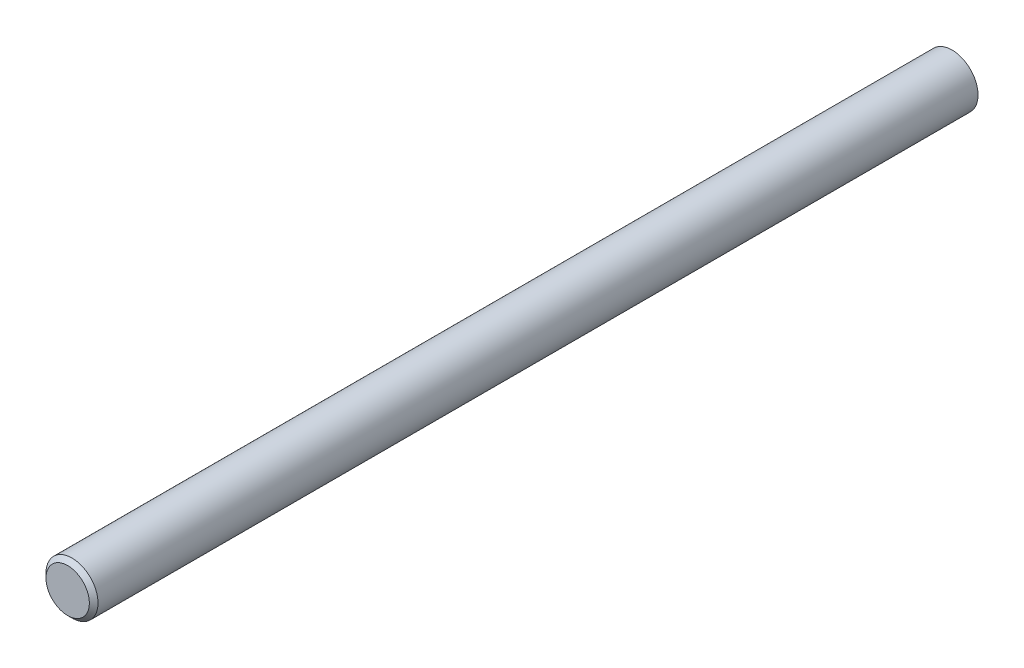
ISO-10303-21;
HEADER;
FILE_DESCRIPTION(('STEP AP214'),'2;1');
FILE_NAME('part.step','',(''),(''),'','','');
FILE_SCHEMA(('AUTOMOTIVE_DESIGN { 1 0 10303 214 1 1 1 1 }'));
ENDSEC;
DATA;
#1=APPLICATION_CONTEXT('core data for automotive mechanical design processes');
#2=APPLICATION_PROTOCOL_DEFINITION('international standard','automotive_design',2000,#1);
#3=PRODUCT_CONTEXT('',#1,'mechanical');
#4=PRODUCT('Part','Part','',(#3));
#5=PRODUCT_RELATED_PRODUCT_CATEGORY('part','',(#4));
#6=PRODUCT_DEFINITION_FORMATION('','',#4);
#7=PRODUCT_DEFINITION_CONTEXT('part definition',#1,'design');
#8=PRODUCT_DEFINITION('design','',#6,#7);
#9=PRODUCT_DEFINITION_SHAPE('','',#8);
#10=(LENGTH_UNIT() NAMED_UNIT(*) SI_UNIT(.MILLI.,.METRE.));
#11=(NAMED_UNIT(*) PLANE_ANGLE_UNIT() SI_UNIT($,.RADIAN.));
#12=(NAMED_UNIT(*) SI_UNIT($,.STERADIAN.) SOLID_ANGLE_UNIT());
#13=UNCERTAINTY_MEASURE_WITH_UNIT(LENGTH_MEASURE(1.E-05),#10,'distance_accuracy_value','');
#14=(GEOMETRIC_REPRESENTATION_CONTEXT(3) GLOBAL_UNCERTAINTY_ASSIGNED_CONTEXT((#13)) GLOBAL_UNIT_ASSIGNED_CONTEXT((#10,
#11,#12)) REPRESENTATION_CONTEXT('',''));
#15=CARTESIAN_POINT('',(0.,0.,0.));
#16=DIRECTION('',(0.,0.,1.));
#17=DIRECTION('',(1.,0.,0.));
#18=AXIS2_PLACEMENT_3D('',#15,#16,#17);
#19=CARTESIAN_POINT('',(-2.62500315,-2.62500315,71.));
#20=DIRECTION('',(0.,0.,1.));
#21=DIRECTION('',(1.,0.,0.));
#22=AXIS2_PLACEMENT_3D('',#19,#20,#21);
#23=PLANE('',#22);
#24=CARTESIAN_POINT('',(1.38994718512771E-13,0.,70.9999999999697));
#25=DIRECTION('',(0.,0.,-1.));
#26=DIRECTION('',(-1.,0.,0.));
#27=AXIS2_PLACEMENT_3D('',#24,#25,#26);
#28=CIRCLE('',#27,2.49999999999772);
#29=CARTESIAN_POINT('',(-2.49999999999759,0.,70.9999999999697));
#30=VERTEX_POINT('',#29);
#31=EDGE_CURVE('E17',#30,#30,#28,.T.);
#32=ORIENTED_EDGE('',*,*,#31,.F.);
#33=EDGE_LOOP('',(#32));
#34=FACE_BOUND('',#33,.T.);
#35=ADVANCED_FACE('F14',(#34),#23,.T.);
#36=CARTESIAN_POINT('',(1.45933612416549E-13,0.,70.4999999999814));
#37=DIRECTION('',(0.,0.,-1.));
#38=DIRECTION('',(-1.,0.,0.));
#39=AXIS2_PLACEMENT_3D('',#36,#37,#38);
#40=CONICAL_SURFACE('',#39,2.99999999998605,0.785398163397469);
#41=ORIENTED_EDGE('',*,*,#31,.T.);
#42=EDGE_LOOP('',(#41));
#43=FACE_BOUND('',#42,.T.);
#44=CARTESIAN_POINT('',(2.86026942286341E-13,-1.47496489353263E-13,70.5));
#45=DIRECTION('',(0.,0.,-1.));
#46=DIRECTION('',(-1.,0.,0.));
#47=AXIS2_PLACEMENT_3D('',#44,#45,#46);
#48=CIRCLE('',#47,3.);
#49=CARTESIAN_POINT('',(-2.99999999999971,-1.47496489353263E-13,70.5));
#50=VERTEX_POINT('',#49);
#51=EDGE_CURVE('E10',#50,#50,#48,.T.);
#52=ORIENTED_EDGE('',*,*,#51,.F.);
#53=EDGE_LOOP('',(#52));
#54=FACE_BOUND('',#53,.T.);
#55=ADVANCED_FACE('F33',(#43,#54),#40,.T.);
#56=CARTESIAN_POINT('',(0.,0.,95.));
#57=DIRECTION('',(0.,0.,-1.));
#58=DIRECTION('',(-1.,0.,0.));
#59=AXIS2_PLACEMENT_3D('',#56,#57,#58);
#60=CYLINDRICAL_SURFACE('',#59,3.);
#61=ORIENTED_EDGE('',*,*,#51,.T.);
#62=EDGE_LOOP('',(#61));
#63=FACE_BOUND('',#62,.T.);
#64=CARTESIAN_POINT('',(0.,0.,-31.));
#65=DIRECTION('',(0.,0.,-1.));
#66=DIRECTION('',(-1.,0.,0.));
#67=AXIS2_PLACEMENT_3D('',#64,#65,#66);
#68=CIRCLE('',#67,2.99999999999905);
#69=CARTESIAN_POINT('',(-2.99999999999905,0.,-31.));
#70=VERTEX_POINT('',#69);
#71=EDGE_CURVE('E24',#70,#70,#68,.T.);
#72=ORIENTED_EDGE('',*,*,#71,.F.);
#73=EDGE_LOOP('',(#72));
#74=FACE_BOUND('',#73,.T.);
#75=ADVANCED_FACE('F31',(#63,#74),#60,.T.);
#76=CARTESIAN_POINT('',(0.,0.,-31.));
#77=DIRECTION('',(0.,0.,-1.));
#78=DIRECTION('',(-1.,0.,0.));
#79=AXIS2_PLACEMENT_3D('',#76,#77,#78);
#80=PLANE('',#79);
#81=ORIENTED_EDGE('',*,*,#71,.T.);
#82=EDGE_LOOP('',(#81));
#83=FACE_BOUND('',#82,.T.);
#84=ADVANCED_FACE('F29',(#83),#80,.T.);
#85=CLOSED_SHELL('',(#35,#55,#75,#84));
#86=MANIFOLD_SOLID_BREP('B1',#85);
#87=ADVANCED_BREP_SHAPE_REPRESENTATION('',(#18,#86),#14);
#88=SHAPE_DEFINITION_REPRESENTATION(#9,#87);
ENDSEC;
END-ISO-10303-21;
